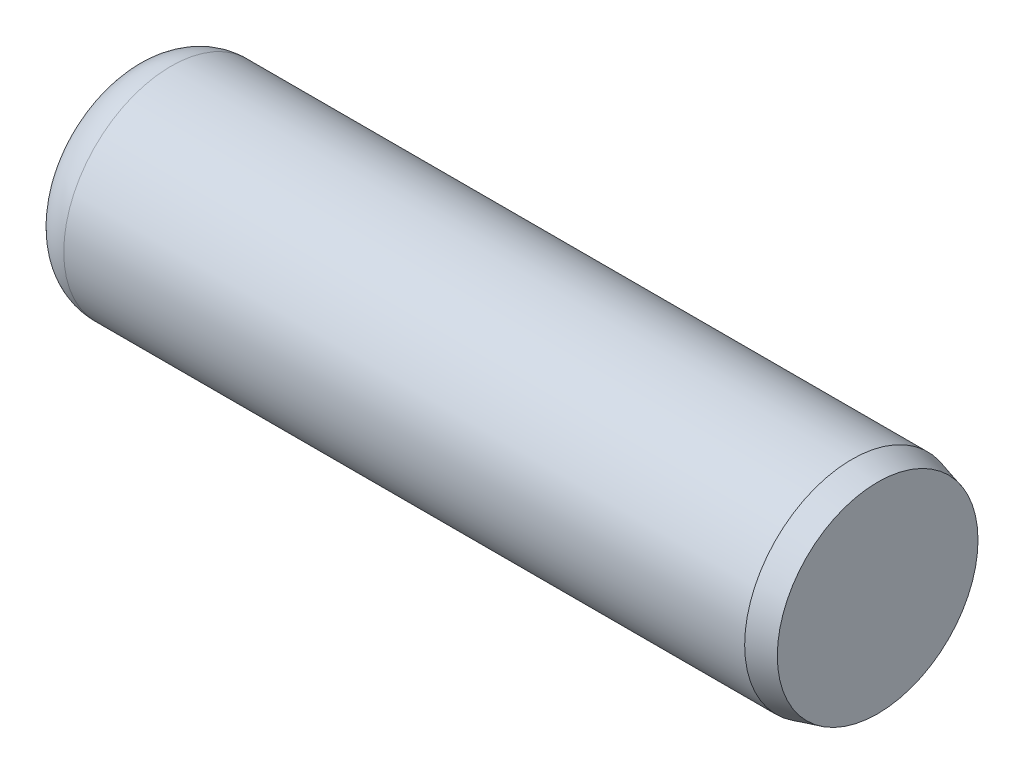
ISO-10303-21;
HEADER;
FILE_DESCRIPTION(('STEP AP214'),'2;1');
FILE_NAME('part.step','',(''),(''),'','','');
FILE_SCHEMA(('AUTOMOTIVE_DESIGN { 1 0 10303 214 1 1 1 1 }'));
ENDSEC;
DATA;
#1=APPLICATION_CONTEXT('core data for automotive mechanical design processes');
#2=APPLICATION_PROTOCOL_DEFINITION('international standard','automotive_design',2000,#1);
#3=PRODUCT_CONTEXT('',#1,'mechanical');
#4=PRODUCT('Part','Part','',(#3));
#5=PRODUCT_RELATED_PRODUCT_CATEGORY('part','',(#4));
#6=PRODUCT_DEFINITION_FORMATION('','',#4);
#7=PRODUCT_DEFINITION_CONTEXT('part definition',#1,'design');
#8=PRODUCT_DEFINITION('design','',#6,#7);
#9=PRODUCT_DEFINITION_SHAPE('','',#8);
#10=(LENGTH_UNIT() NAMED_UNIT(*) SI_UNIT(.MILLI.,.METRE.));
#11=(NAMED_UNIT(*) PLANE_ANGLE_UNIT() SI_UNIT($,.RADIAN.));
#12=(NAMED_UNIT(*) SI_UNIT($,.STERADIAN.) SOLID_ANGLE_UNIT());
#13=UNCERTAINTY_MEASURE_WITH_UNIT(LENGTH_MEASURE(1.E-05),#10,'distance_accuracy_value','');
#14=(GEOMETRIC_REPRESENTATION_CONTEXT(3) GLOBAL_UNCERTAINTY_ASSIGNED_CONTEXT((#13)) GLOBAL_UNIT_ASSIGNED_CONTEXT((#10,
#11,#12)) REPRESENTATION_CONTEXT('',''));
#15=CARTESIAN_POINT('',(0.,0.,0.));
#16=DIRECTION('',(0.,0.,1.));
#17=DIRECTION('',(1.,0.,0.));
#18=AXIS2_PLACEMENT_3D('',#15,#16,#17);
#19=CARTESIAN_POINT('',(0.,0.954023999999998,0.));
#20=DIRECTION('',(1.,0.,0.));
#21=DIRECTION('',(0.,0.,-1.));
#22=AXIS2_PLACEMENT_3D('',#19,#20,#21);
#23=PLANE('',#22);
#24=CARTESIAN_POINT('',(0.,0.,0.));
#25=DIRECTION('',(-1.,0.,0.));
#26=DIRECTION('',(0.,0.,1.));
#27=AXIS2_PLACEMENT_3D('',#24,#25,#26);
#28=CIRCLE('',#27,0.954023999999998);
#29=CARTESIAN_POINT('',(0.,0.,0.954023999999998));
#30=VERTEX_POINT('',#29);
#31=EDGE_CURVE('E43',#30,#30,#28,.T.);
#32=ORIENTED_EDGE('',*,*,#31,.T.);
#33=EDGE_LOOP('',(#32));
#34=FACE_BOUND('',#33,.T.);
#35=ADVANCED_FACE('F29',(#34),#23,.F.);
#36=CARTESIAN_POINT('',(11.1125,0.,0.));
#37=DIRECTION('',(-1.,0.,0.));
#38=DIRECTION('',(0.,0.,1.));
#39=AXIS2_PLACEMENT_3D('',#36,#37,#38);
#40=PLANE('',#39);
#41=CARTESIAN_POINT('',(11.1125,0.,0.));
#42=DIRECTION('',(-1.,0.,0.));
#43=DIRECTION('',(0.,0.,1.));
#44=AXIS2_PLACEMENT_3D('',#41,#42,#43);
#45=CIRCLE('',#44,1.48778801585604);
#46=CARTESIAN_POINT('',(11.1125,0.,1.48778801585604));
#47=VERTEX_POINT('',#46);
#48=EDGE_CURVE('E10',#47,#47,#45,.T.);
#49=ORIENTED_EDGE('',*,*,#48,.F.);
#50=EDGE_LOOP('',(#49));
#51=FACE_BOUND('',#50,.T.);
#52=ADVANCED_FACE('F63',(#51),#40,.F.);
#53=CARTESIAN_POINT('',(11.1125,0.,0.));
#54=DIRECTION('',(-1.,0.,0.));
#55=DIRECTION('',(0.,0.,1.));
#56=AXIS2_PLACEMENT_3D('',#53,#54,#55);
#57=CONICAL_SURFACE('',#56,1.48778801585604,0.261799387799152);
#58=CARTESIAN_POINT('',(10.7308904,0.,0.));
#59=DIRECTION('',(-1.,0.,0.));
#60=DIRECTION('',(0.,0.,1.));
#61=AXIS2_PLACEMENT_3D('',#58,#59,#60);
#62=CIRCLE('',#61,1.59004);
#63=CARTESIAN_POINT('',(10.7308904,0.,1.59004));
#64=VERTEX_POINT('',#63);
#65=EDGE_CURVE('E35',#64,#64,#62,.T.);
#66=ORIENTED_EDGE('',*,*,#65,.F.);
#67=EDGE_LOOP('',(#66));
#68=FACE_BOUND('',#67,.T.);
#69=ORIENTED_EDGE('',*,*,#48,.T.);
#70=EDGE_LOOP('',(#69));
#71=FACE_BOUND('',#70,.T.);
#72=ADVANCED_FACE('F58',(#68,#71),#57,.T.);
#73=CARTESIAN_POINT('',(-6.35,0.,0.));
#74=DIRECTION('',(-1.,0.,0.));
#75=DIRECTION('',(0.,0.,1.));
#76=AXIS2_PLACEMENT_3D('',#73,#74,#75);
#77=CYLINDRICAL_SURFACE('',#76,1.59004);
#78=CARTESIAN_POINT('',(0.636016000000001,0.,0.));
#79=DIRECTION('',(-1.,0.,0.));
#80=DIRECTION('',(0.,0.,1.));
#81=AXIS2_PLACEMENT_3D('',#78,#79,#80);
#82=CIRCLE('',#81,1.59004);
#83=CARTESIAN_POINT('',(0.636016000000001,0.,1.59004));
#84=VERTEX_POINT('',#83);
#85=EDGE_CURVE('E39',#84,#84,#82,.T.);
#86=ORIENTED_EDGE('',*,*,#85,.F.);
#87=EDGE_LOOP('',(#86));
#88=FACE_BOUND('',#87,.T.);
#89=ORIENTED_EDGE('',*,*,#65,.T.);
#90=EDGE_LOOP('',(#89));
#91=FACE_BOUND('',#90,.T.);
#92=ADVANCED_FACE('F53',(#88,#91),#77,.T.);
#93=CARTESIAN_POINT('',(0.636016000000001,0.,0.));
#94=DIRECTION('',(-1.,0.,0.));
#95=DIRECTION('',(0.,0.,1.));
#96=AXIS2_PLACEMENT_3D('',#93,#94,#95);
#97=TOROIDAL_SURFACE('',#96,0.954023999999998,0.636016);
#98=ORIENTED_EDGE('',*,*,#31,.F.);
#99=EDGE_LOOP('',(#98));
#100=FACE_BOUND('',#99,.T.);
#101=ORIENTED_EDGE('',*,*,#85,.T.);
#102=EDGE_LOOP('',(#101));
#103=FACE_BOUND('',#102,.T.);
#104=ADVANCED_FACE('F50',(#100,#103),#97,.T.);
#105=CLOSED_SHELL('',(#35,#52,#72,#92,#104));
#106=MANIFOLD_SOLID_BREP('B2',#105);
#107=ADVANCED_BREP_SHAPE_REPRESENTATION('',(#18,#106),#14);
#108=SHAPE_DEFINITION_REPRESENTATION(#9,#107);
ENDSEC;
END-ISO-10303-21;
